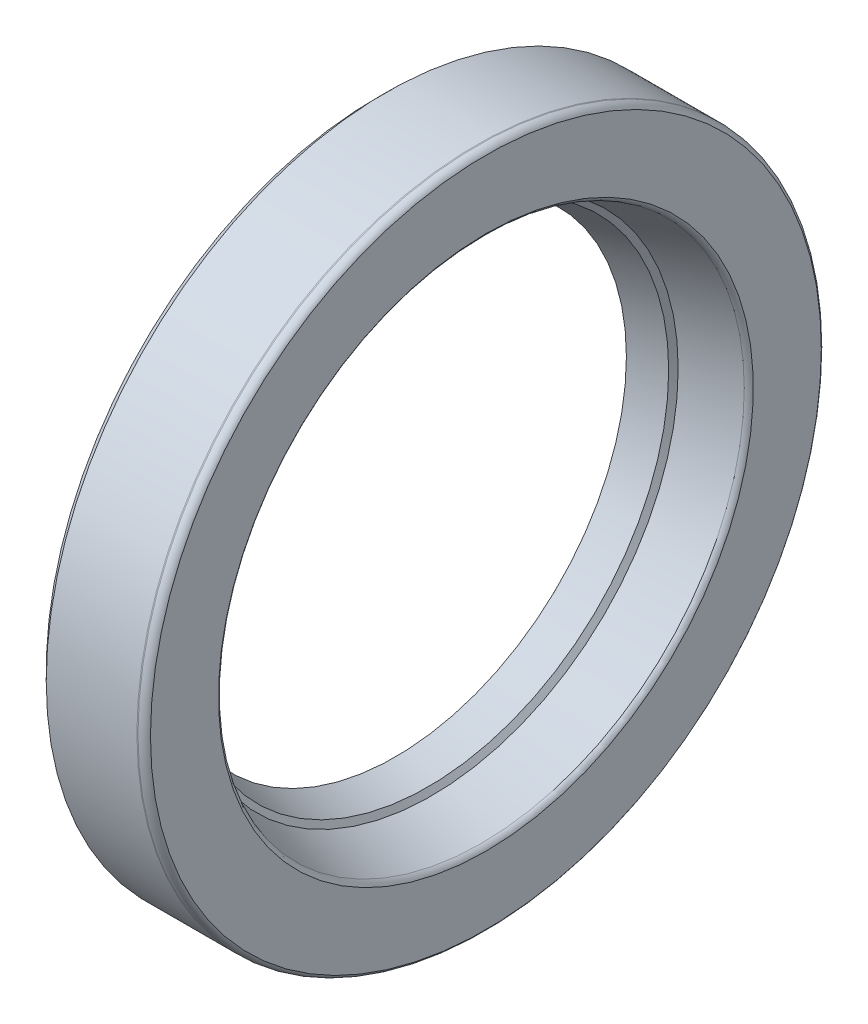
ISO-10303-21;
HEADER;
FILE_DESCRIPTION(('STEP AP214'),'2;1');
FILE_NAME('part.step','',(''),(''),'','','');
FILE_SCHEMA(('AUTOMOTIVE_DESIGN { 1 0 10303 214 1 1 1 1 }'));
ENDSEC;
DATA;
#1=APPLICATION_CONTEXT('core data for automotive mechanical design processes');
#2=APPLICATION_PROTOCOL_DEFINITION('international standard','automotive_design',2000,#1);
#3=PRODUCT_CONTEXT('',#1,'mechanical');
#4=PRODUCT('Part','Part','',(#3));
#5=PRODUCT_RELATED_PRODUCT_CATEGORY('part','',(#4));
#6=PRODUCT_DEFINITION_FORMATION('','',#4);
#7=PRODUCT_DEFINITION_CONTEXT('part definition',#1,'design');
#8=PRODUCT_DEFINITION('design','',#6,#7);
#9=PRODUCT_DEFINITION_SHAPE('','',#8);
#10=(LENGTH_UNIT() NAMED_UNIT(*) SI_UNIT(.MILLI.,.METRE.));
#11=(NAMED_UNIT(*) PLANE_ANGLE_UNIT() SI_UNIT($,.RADIAN.));
#12=(NAMED_UNIT(*) SI_UNIT($,.STERADIAN.) SOLID_ANGLE_UNIT());
#13=UNCERTAINTY_MEASURE_WITH_UNIT(LENGTH_MEASURE(1.E-05),#10,'distance_accuracy_value','');
#14=(GEOMETRIC_REPRESENTATION_CONTEXT(3) GLOBAL_UNCERTAINTY_ASSIGNED_CONTEXT((#13)) GLOBAL_UNIT_ASSIGNED_CONTEXT((#10,
#11,#12)) REPRESENTATION_CONTEXT('',''));
#15=CARTESIAN_POINT('',(0.,0.,0.));
#16=DIRECTION('',(0.,0.,1.));
#17=DIRECTION('',(1.,0.,0.));
#18=AXIS2_PLACEMENT_3D('',#15,#16,#17);
#19=CARTESIAN_POINT('',(2.4,0.,0.));
#20=DIRECTION('',(1.,0.,0.));
#21=DIRECTION('',(0.,0.,-1.));
#22=AXIS2_PLACEMENT_3D('',#19,#20,#21);
#23=CONICAL_SURFACE('',#22,9.83333333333,0.233743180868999);
#24=CARTESIAN_POINT('',(1.48640310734,0.,0.));
#25=DIRECTION('',(-1.,0.,0.));
#26=DIRECTION('',(0.,-1.,0.));
#27=AXIS2_PLACEMENT_3D('',#24,#25,#26);
#28=CIRCLE('',#27,9.61581026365);
#29=CARTESIAN_POINT('',(1.48640310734,-9.61581026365,0.));
#30=VERTEX_POINT('',#29);
#31=EDGE_CURVE('E92',#30,#30,#28,.T.);
#32=ORIENTED_EDGE('',*,*,#31,.F.);
#33=EDGE_LOOP('',(#32));
#34=FACE_BOUND('',#33,.T.);
#35=CARTESIAN_POINT('',(2.4,0.,0.));
#36=DIRECTION('',(1.,0.,0.));
#37=DIRECTION('',(0.,0.,-1.));
#38=AXIS2_PLACEMENT_3D('',#35,#36,#37);
#39=CIRCLE('',#38,9.83333333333);
#40=CARTESIAN_POINT('',(2.4,0.,-9.83333333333));
#41=VERTEX_POINT('',#40);
#42=EDGE_CURVE('E21',#41,#41,#39,.T.);
#43=ORIENTED_EDGE('',*,*,#42,.F.);
#44=EDGE_LOOP('',(#43));
#45=FACE_BOUND('',#44,.T.);
#46=ADVANCED_FACE('F17',(#34,#45),#23,.T.);
#47=CARTESIAN_POINT('',(2.4,10.5833333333,0.));
#48=DIRECTION('',(-1.,0.,0.));
#49=DIRECTION('',(0.,0.,1.));
#50=AXIS2_PLACEMENT_3D('',#47,#48,#49);
#51=PLANE('',#50);
#52=ORIENTED_EDGE('',*,*,#42,.T.);
#53=EDGE_LOOP('',(#52));
#54=FACE_BOUND('',#53,.T.);
#55=CARTESIAN_POINT('',(2.4,-2.48353282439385E-10,-11.3333333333));
#56=CARTESIAN_POINT('',(2.4,0.222347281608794,-11.3333425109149));
#57=CARTESIAN_POINT('',(2.4,0.444699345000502,-11.3267906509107));
#58=CARTESIAN_POINT('',(2.4,0.889019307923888,-11.3006036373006));
#59=CARTESIAN_POINT('',(2.4,1.11098587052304,-11.2809457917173));
#60=CARTESIAN_POINT('',(2.4,1.55336648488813,-11.2285856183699));
#61=CARTESIAN_POINT('',(2.4,1.77378051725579,-11.195883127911));
#62=CARTESIAN_POINT('',(2.4,2.3021759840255,-11.1014857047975));
#63=CARTESIAN_POINT('',(2.4,2.60903890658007,-11.033401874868));
#64=CARTESIAN_POINT('',(2.4,3.21607977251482,-10.8719803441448));
#65=CARTESIAN_POINT('',(2.4,3.51625656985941,-10.778638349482));
#66=CARTESIAN_POINT('',(2.4,4.10781237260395,-10.5673530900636));
#67=CARTESIAN_POINT('',(2.4,4.39919184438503,-10.4494111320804));
#68=CARTESIAN_POINT('',(2.4,4.97113041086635,-10.1897467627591));
#69=CARTESIAN_POINT('',(2.4,5.25169019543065,-10.0480258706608));
#70=CARTESIAN_POINT('',(2.4,5.80008230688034,-9.74177206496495));
#71=CARTESIAN_POINT('',(2.4,6.06791422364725,-9.57723841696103));
#72=CARTESIAN_POINT('',(2.4,6.58899022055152,-9.22649918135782));
#73=CARTESIAN_POINT('',(2.4,6.8422343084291,-9.0402936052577));
#74=CARTESIAN_POINT('',(2.4,7.33242731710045,-8.64746333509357));
#75=CARTESIAN_POINT('',(2.4,7.56937346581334,-8.44083518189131));
#76=CARTESIAN_POINT('',(2.4,8.02520914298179,-8.00868672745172));
#77=CARTESIAN_POINT('',(2.4,8.24410476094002,-7.78317284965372));
#78=CARTESIAN_POINT('',(2.4,8.66172810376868,-7.31552225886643));
#79=CARTESIAN_POINT('',(2.4,8.8605198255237,-7.07344268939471));
#80=CARTESIAN_POINT('',(2.4,9.23739003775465,-6.57366089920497));
#81=CARTESIAN_POINT('',(2.4,9.41546852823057,-6.31595867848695));
#82=CARTESIAN_POINT('',(2.4,9.75027421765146,-5.78578020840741));
#83=CARTESIAN_POINT('',(2.4,9.90692410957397,-5.51325517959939));
#84=CARTESIAN_POINT('',(2.4,10.1970516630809,-4.95612569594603));
#85=CARTESIAN_POINT('',(2.4,10.3305314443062,-4.67152234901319));
#86=CARTESIAN_POINT('',(2.4,10.5124495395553,-4.23761271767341));
#87=CARTESIAN_POINT('',(2.4,10.569960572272,-4.09204905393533));
#88=CARTESIAN_POINT('',(2.4,10.6789088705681,-3.79866226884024));
#89=CARTESIAN_POINT('',(2.4,10.7303460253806,-3.65083910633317));
#90=CARTESIAN_POINT('',(2.4,10.8757337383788,-3.20334762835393));
#91=CARTESIAN_POINT('',(2.4,10.9603660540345,-2.90059820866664));
#92=CARTESIAN_POINT('',(2.4,11.1041899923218,-2.28911702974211));
#93=CARTESIAN_POINT('',(2.4,11.1633817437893,-1.98038530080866));
#94=CARTESIAN_POINT('',(2.4,11.2327069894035,-1.51500689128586));
#95=CARTESIAN_POINT('',(2.4,11.2525550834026,-1.35975549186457));
#96=CARTESIAN_POINT('',(2.4,11.2858072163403,-1.04856396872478));
#97=CARTESIAN_POINT('',(2.4,11.2992112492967,-0.892623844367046));
#98=CARTESIAN_POINT('',(2.4,11.3297838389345,-0.423103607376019));
#99=CARTESIAN_POINT('',(2.4,11.3371622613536,-0.108834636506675));
#100=CARTESIAN_POINT('',(2.4,11.325788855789,0.519230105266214));
#101=CARTESIAN_POINT('',(2.4,11.3070370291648,0.833025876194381));
#102=CARTESIAN_POINT('',(2.4,11.2594853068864,1.30113135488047));
#103=CARTESIAN_POINT('',(2.4,11.2404441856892,1.45648392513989));
#104=CARTESIAN_POINT('',(2.4,11.1959470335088,1.76626751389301));
#105=CARTESIAN_POINT('',(2.4,11.1704910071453,1.9206985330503));
#106=CARTESIAN_POINT('',(2.4,11.0843619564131,2.38326205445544));
#107=CARTESIAN_POINT('',(2.4,11.014031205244,2.68964846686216));
#108=CARTESIAN_POINT('',(2.4,10.8481625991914,3.29552152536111));
#109=CARTESIAN_POINT('',(2.4,10.752624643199,3.59500814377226));
#110=CARTESIAN_POINT('',(2.4,10.5911307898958,4.03694197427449));
#111=CARTESIAN_POINT('',(2.4,10.5343754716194,4.18280564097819));
#112=CARTESIAN_POINT('',(2.4,10.4148764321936,4.472055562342));
#113=CARTESIAN_POINT('',(2.4,10.352132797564,4.61544185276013));
#114=CARTESIAN_POINT('',(2.4,10.1546227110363,5.0424835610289));
#115=CARTESIAN_POINT('',(2.4,10.0109247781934,5.32207023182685));
#116=CARTESIAN_POINT('',(2.4,9.70081588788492,5.86833001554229));
#117=CARTESIAN_POINT('',(2.4,9.53440328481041,6.13500219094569));
#118=CARTESIAN_POINT('',(2.4,9.18062349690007,6.652708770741));
#119=CARTESIAN_POINT('',(2.4,8.99333159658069,6.90379458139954));
#120=CARTESIAN_POINT('',(2.4,8.59861350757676,7.38960407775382));
#121=CARTESIAN_POINT('',(2.4,8.39118731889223,7.62432776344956));
#122=CARTESIAN_POINT('',(2.4,7.9576225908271,8.07580574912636));
#123=CARTESIAN_POINT('',(2.4,7.73148405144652,8.29256004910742));
#124=CARTESIAN_POINT('',(2.4,7.26127479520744,8.70729174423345));
#125=CARTESIAN_POINT('',(2.4,7.01714766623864,8.90520518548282));
#126=CARTESIAN_POINT('',(2.4,6.51320986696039,9.28015163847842));
#127=CARTESIAN_POINT('',(2.4,6.25339329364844,9.45717671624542));
#128=CARTESIAN_POINT('',(2.4,5.72000542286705,9.78900474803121));
#129=CARTESIAN_POINT('',(2.4,5.44643677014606,9.94381195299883));
#130=CARTESIAN_POINT('',(2.4,4.887391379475,10.230175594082));
#131=CARTESIAN_POINT('',(2.4,4.60191458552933,10.3617319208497));
#132=CARTESIAN_POINT('',(2.4,4.02103574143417,10.6006750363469));
#133=CARTESIAN_POINT('',(2.4,3.72563456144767,10.7080639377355));
#134=CARTESIAN_POINT('',(2.4,3.12693092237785,10.8979566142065));
#135=CARTESIAN_POINT('',(2.4,2.82362712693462,10.9804561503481));
#136=CARTESIAN_POINT('',(2.4,2.10504009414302,11.144139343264));
#137=CARTESIAN_POINT('',(2.4,1.68733060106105,11.2149862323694));
#138=CARTESIAN_POINT('',(2.4,1.05683139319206,11.2859408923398));
#139=CARTESIAN_POINT('',(2.4,0.845865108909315,11.3037065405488));
#140=CARTESIAN_POINT('',(2.4,0.42328376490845,11.3274012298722));
#141=CARTESIAN_POINT('',(2.4,0.211668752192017,11.3333311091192));
#142=CARTESIAN_POINT('',(2.4,-2.48342924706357E-10,11.3333333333));
#143=B_SPLINE_CURVE_WITH_KNOTS('',3,(#55,#56,#57,#58,#59,#60,#61,#62,#63,#64,#65,#66,#67,#68,
#69,#70,#71,#72,#73,#74,#75,#76,#77,#78,#79,#80,#81,#82,#83,#84,#85,#86,#87,#88,#89,#90,#91,#92,
#93,#94,#95,#96,#97,#98,#99,#100,#101,#102,#103,#104,#105,#106,#107,#108,#109,#110,#111,#112,
#113,#114,#115,#116,#117,#118,#119,#120,#121,#122,#123,#124,#125,#126,#127,#128,#129,#130,#131,
#132,#133,#134,#135,#136,#137,#138,#139,#140,#141,#142),.UNSPECIFIED.,.F.,.F.,(4,2,2,2,2,2,2,2,
2,2,2,2,2,2,2,2,2,2,2,2,2,2,2,2,2,2,2,2,2,2,2,2,2,2,2,2,2,2,2,2,2,2,2,4),(0.,0.666955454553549,
1.33506869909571,2.00319027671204,2.94502316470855,3.88701626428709,4.8289593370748,
5.7708422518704,6.71275549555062,7.65466823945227,8.59674079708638,9.53849422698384,
10.4771485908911,11.4158029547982,12.3577590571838,13.2996289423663,13.7690525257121,
14.238484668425,15.1804000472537,16.1223106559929,16.5917383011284,17.0611663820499,
18.0030794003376,18.9449923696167,19.4144204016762,19.8838480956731,20.825759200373,
21.7676740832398,22.2371053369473,22.7065298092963,23.6484086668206,24.5903557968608,
25.5290101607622,26.4676645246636,27.406318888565,28.3480536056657,29.2901448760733,
30.2320556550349,31.1739708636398,32.1158037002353,33.0577968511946,34.3257996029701,
34.9606605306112,35.595476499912),.UNSPECIFIED.);
#144=CARTESIAN_POINT('',(2.4,-2.48352477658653E-10,-11.3333333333));
#145=VERTEX_POINT('',#144);
#146=CARTESIAN_POINT('',(2.4,-1.24175253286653E-10,11.3333333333));
#147=VERTEX_POINT('',#146);
#148=EDGE_CURVE('E66',#145,#147,#143,.T.);
#149=ORIENTED_EDGE('',*,*,#148,.F.);
#150=CARTESIAN_POINT('',(2.4,-2.48351894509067E-10,11.3333333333));
#151=CARTESIAN_POINT('',(2.4,-0.222347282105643,11.3333425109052));
#152=CARTESIAN_POINT('',(2.4,-0.444699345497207,11.3267906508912));
#153=CARTESIAN_POINT('',(2.4,-0.889019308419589,11.3006036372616));
#154=CARTESIAN_POINT('',(2.4,-1.11098587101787,11.2809457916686));
#155=CARTESIAN_POINT('',(2.4,-1.55336648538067,11.2285856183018));
#156=CARTESIAN_POINT('',(2.4,-1.7737805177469,11.1958831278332));
#157=CARTESIAN_POINT('',(2.4,-2.30217598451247,11.1014857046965));
#158=CARTESIAN_POINT('',(2.4,-2.60903890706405,11.0334018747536));
#159=CARTESIAN_POINT('',(2.4,-3.21607977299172,10.8719803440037));
#160=CARTESIAN_POINT('',(2.4,-3.51625657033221,10.7786383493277));
#161=CARTESIAN_POINT('',(2.4,-4.10781237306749,10.5673530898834));
#162=CARTESIAN_POINT('',(2.4,-4.39919184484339,10.4494111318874));
#163=CARTESIAN_POINT('',(2.4,-4.97113041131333,10.189746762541));
#164=CARTESIAN_POINT('',(2.4,-5.25169019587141,10.0480258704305));
#165=CARTESIAN_POINT('',(2.4,-5.80008230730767,9.74177206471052));
#166=CARTESIAN_POINT('',(2.4,-6.06791422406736,9.57723841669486));
#167=CARTESIAN_POINT('',(2.4,-6.58899022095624,9.22649918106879));
#168=CARTESIAN_POINT('',(2.4,-6.84223430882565,9.04029360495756));
#169=CARTESIAN_POINT('',(2.4,-7.33242731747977,8.64746333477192));
#170=CARTESIAN_POINT('',(2.4,-7.5693734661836,8.44083518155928));
#171=CARTESIAN_POINT('',(2.4,-8.0252091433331,8.00868672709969));
#172=CARTESIAN_POINT('',(2.4,-8.24410476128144,7.78317284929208));
#173=CARTESIAN_POINT('',(2.4,-8.66172810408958,7.31552225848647));
#174=CARTESIAN_POINT('',(2.4,-8.86051982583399,7.07344268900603));
#175=CARTESIAN_POINT('',(2.4,-9.23739003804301,6.57366089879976));
#176=CARTESIAN_POINT('',(2.4,-9.41546852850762,6.31595867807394));
#177=CARTESIAN_POINT('',(2.4,-9.75027421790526,5.7857802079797));
#178=CARTESIAN_POINT('',(2.4,-9.90692410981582,5.51325517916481));
#179=CARTESIAN_POINT('',(2.4,-10.1970516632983,4.95612569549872));
#180=CARTESIAN_POINT('',(2.4,-10.3305314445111,4.67152234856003));
#181=CARTESIAN_POINT('',(2.4,-10.5124495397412,4.23761271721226));
#182=CARTESIAN_POINT('',(2.4,-10.5699605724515,4.09204905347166));
#183=CARTESIAN_POINT('',(2.4,-10.6789088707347,3.79866226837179));
#184=CARTESIAN_POINT('',(2.4,-10.7303460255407,3.65083910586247));
#185=CARTESIAN_POINT('',(2.4,-10.8757337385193,3.20334762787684));
#186=CARTESIAN_POINT('',(2.4,-10.9603660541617,2.90059820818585));
#187=CARTESIAN_POINT('',(2.4,-11.1041899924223,2.28911702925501));
#188=CARTESIAN_POINT('',(2.4,-11.1633817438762,1.98038530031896));
#189=CARTESIAN_POINT('',(2.4,-11.23270698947,1.51500689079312));
#190=CARTESIAN_POINT('',(2.4,-11.2525550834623,1.35975549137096));
#191=CARTESIAN_POINT('',(2.4,-11.2858072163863,1.04856396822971));
#192=CARTESIAN_POINT('',(2.4,-11.2992112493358,0.892623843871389));
#193=CARTESIAN_POINT('',(2.4,-11.329783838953,0.423103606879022));
#194=CARTESIAN_POINT('',(2.4,-11.3371622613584,0.108834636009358));
#195=CARTESIAN_POINT('',(2.4,-11.3257888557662,-0.519230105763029));
#196=CARTESIAN_POINT('',(2.4,-11.3070370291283,-0.833025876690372));
#197=CARTESIAN_POINT('',(2.4,-11.2594853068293,-1.30113135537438));
#198=CARTESIAN_POINT('',(2.4,-11.2404441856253,-1.45648392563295));
#199=CARTESIAN_POINT('',(2.4,-11.1959470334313,-1.76626751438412));
#200=CARTESIAN_POINT('',(2.4,-11.170491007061,-1.92069853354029));
#201=CARTESIAN_POINT('',(2.4,-11.0843619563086,-2.38326205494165));
#202=CARTESIAN_POINT('',(2.4,-11.014031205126,-2.68964846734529));
#203=CARTESIAN_POINT('',(2.4,-10.8481625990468,-3.29552152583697));
#204=CARTESIAN_POINT('',(2.4,-10.7526246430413,-3.59500814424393));
#205=CARTESIAN_POINT('',(2.4,-10.5911307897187,-4.03694197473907));
#206=CARTESIAN_POINT('',(2.4,-10.5343754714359,-4.18280564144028));
#207=CARTESIAN_POINT('',(2.4,-10.4148764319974,-4.47205556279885));
#208=CARTESIAN_POINT('',(2.4,-10.3521327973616,-4.61544185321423));
#209=CARTESIAN_POINT('',(2.4,-10.1546227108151,-5.04248356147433));
#210=CARTESIAN_POINT('',(2.4,-10.01092477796,-5.32207023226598));
#211=CARTESIAN_POINT('',(2.4,-9.70081588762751,-5.86833001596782));
#212=CARTESIAN_POINT('',(2.4,-9.53440328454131,-6.13500219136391));
#213=CARTESIAN_POINT('',(2.4,-9.18062349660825,-6.6527087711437));
#214=CARTESIAN_POINT('',(2.4,-8.99333159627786,-6.90379458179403));
#215=CARTESIAN_POINT('',(2.4,-8.59861350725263,-7.389604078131));
#216=CARTESIAN_POINT('',(2.4,-8.39118731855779,-7.62432776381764));
#217=CARTESIAN_POINT('',(2.4,-7.95762259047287,-8.07580574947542));
#218=CARTESIAN_POINT('',(2.4,-7.73148405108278,-8.29256004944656));
#219=CARTESIAN_POINT('',(2.4,-7.2612747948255,-8.70729174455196));
#220=CARTESIAN_POINT('',(2.4,-7.01714766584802,-8.90520518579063));
#221=CARTESIAN_POINT('',(2.4,-6.51320986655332,-9.28015163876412));
#222=CARTESIAN_POINT('',(2.4,-6.25339329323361,-9.45717671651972));
#223=CARTESIAN_POINT('',(2.4,-5.72000542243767,-9.78900474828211));
#224=CARTESIAN_POINT('',(2.4,-5.44643676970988,-9.94381195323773));
#225=CARTESIAN_POINT('',(2.4,-4.88739137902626,-10.2301755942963));
#226=CARTESIAN_POINT('',(2.4,-4.60191458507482,-10.3617319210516));
#227=CARTESIAN_POINT('',(2.4,-4.02103574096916,-10.6006750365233));
#228=CARTESIAN_POINT('',(2.4,-3.72563456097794,-10.708063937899));
#229=CARTESIAN_POINT('',(2.4,-3.12693092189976,-10.8979566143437));
#230=CARTESIAN_POINT('',(2.4,-2.8236271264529,-10.980456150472));
#231=CARTESIAN_POINT('',(2.4,-2.10504009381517,-11.1441393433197));
#232=CARTESIAN_POINT('',(2.4,-1.68733060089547,-11.2149862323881));
#233=CARTESIAN_POINT('',(2.4,-1.05683139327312,-11.2859408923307));
#234=CARTESIAN_POINT('',(2.4,-0.845865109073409,-11.3037065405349));
#235=CARTESIAN_POINT('',(2.4,-0.423283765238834,-11.3274012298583));
#236=CARTESIAN_POINT('',(2.4,-0.211668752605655,-11.33333110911));
#237=CARTESIAN_POINT('',(2.4,-2.48361738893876E-10,-11.3333333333));
#238=B_SPLINE_CURVE_WITH_KNOTS('',3,(#150,#151,#152,#153,#154,#155,#156,#157,#158,#159,#160,
#161,#162,#163,#164,#165,#166,#167,#168,#169,#170,#171,#172,#173,#174,#175,#176,#177,#178,#179,
#180,#181,#182,#183,#184,#185,#186,#187,#188,#189,#190,#191,#192,#193,#194,#195,#196,#197,#198,
#199,#200,#201,#202,#203,#204,#205,#206,#207,#208,#209,#210,#211,#212,#213,#214,#215,#216,#217,
#218,#219,#220,#221,#222,#223,#224,#225,#226,#227,#228,#229,#230,#231,#232,#233,#234,#235,#236,
#237),.UNSPECIFIED.,.F.,.F.,(4,2,2,2,2,2,2,2,2,2,2,2,2,2,2,2,2,2,2,2,2,2,2,2,2,2,2,2,2,2,2,2,2,
2,2,2,2,2,2,2,2,2,2,4),(0.,0.66695545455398,1.33506869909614,2.00319027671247,2.94502316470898,
3.88701626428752,4.82895933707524,5.77084225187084,6.71275549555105,7.65466823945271,
8.59674079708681,9.53849422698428,10.4771485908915,11.4158029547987,12.3577590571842,
13.2996289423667,13.7690525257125,14.2384846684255,15.1804000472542,16.1223106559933,
16.5917383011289,17.0611663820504,18.0030794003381,18.9449923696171,19.4144204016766,
19.8838480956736,20.8257592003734,21.7676740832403,22.2371053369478,22.7065298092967,
23.648408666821,24.5903557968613,25.5290101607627,26.467664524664,27.4063188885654,
28.3480536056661,29.2901448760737,30.2320556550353,31.1739708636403,32.1158037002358,
33.057796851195,34.3257996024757,34.9606605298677,35.5954764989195),.UNSPECIFIED.);
#239=EDGE_CURVE('E56',#147,#145,#238,.T.);
#240=ORIENTED_EDGE('',*,*,#239,.F.);
#241=EDGE_LOOP('',(#149,#240));
#242=FACE_BOUND('',#241,.T.);
#243=ADVANCED_FACE('F67',(#54,#242),#51,.T.);
#244=CARTESIAN_POINT('',(1.00000000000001,0.,0.));
#245=DIRECTION('',(1.,0.,0.));
#246=DIRECTION('',(0.,0.,-1.));
#247=AXIS2_PLACEMENT_3D('',#244,#245,#246);
#248=TOROIDAL_SURFACE('',#247,9.49999999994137,0.500000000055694);
#249=ORIENTED_EDGE('',*,*,#31,.T.);
#250=EDGE_LOOP('',(#249));
#251=FACE_BOUND('',#250,.T.);
#252=CARTESIAN_POINT('',(0.782055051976,0.,0.));
#253=DIRECTION('',(1.,0.,0.));
#254=DIRECTION('',(0.,0.,-1.));
#255=AXIS2_PLACEMENT_3D('',#252,#253,#254);
#256=CIRCLE('',#255,9.95);
#257=CARTESIAN_POINT('',(0.782055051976,0.,-9.95));
#258=VERTEX_POINT('',#257);
#259=EDGE_CURVE('E69',#258,#258,#256,.F.);
#260=ORIENTED_EDGE('',*,*,#259,.F.);
#261=EDGE_LOOP('',(#260));
#262=FACE_BOUND('',#261,.T.);
#263=ADVANCED_FACE('F203',(#251,#262),#248,.T.);
#264=CARTESIAN_POINT('',(2.23333333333,0.,11.5));
#265=CARTESIAN_POINT('',(2.23333333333,-23.,11.5));
#266=CARTESIAN_POINT('',(2.23333333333,-23.,-11.5));
#267=CARTESIAN_POINT('',(2.23333333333,0.,-11.5));
#268=CARTESIAN_POINT('',(2.3081646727,0.,11.4662199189));
#269=CARTESIAN_POINT('',(2.3081646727,-22.9324398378,11.4662199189));
#270=CARTESIAN_POINT('',(2.3081646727,-22.9324398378,-11.4662199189));
#271=CARTESIAN_POINT('',(2.3081646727,0.,-11.4662199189));
#272=CARTESIAN_POINT('',(2.36621991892,0.,11.4081646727));
#273=CARTESIAN_POINT('',(2.36621991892,-22.8163293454,11.4081646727));
#274=CARTESIAN_POINT('',(2.36621991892,-22.8163293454,-11.4081646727));
#275=CARTESIAN_POINT('',(2.36621991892,0.,-11.4081646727));
#276=CARTESIAN_POINT('',(2.4,0.,11.3333333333));
#277=CARTESIAN_POINT('',(2.4,-22.6666666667,11.3333333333));
#278=CARTESIAN_POINT('',(2.4,-22.6666666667,-11.3333333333));
#279=CARTESIAN_POINT('',(2.4,0.,-11.3333333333));
#280=(BOUNDED_SURFACE() B_SPLINE_SURFACE(3,3,((#264,#265,#266,#267),(#268,#269,#270,#271),(#272,
#273,#274,#275),(#276,#277,#278,#279)),.UNSPECIFIED.,.F.,.F.,
.F.) B_SPLINE_SURFACE_WITH_KNOTS((4,4),(4,4),(0.,0.332771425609),(0.,68.5615768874),
.UNSPECIFIED.) GEOMETRIC_REPRESENTATION_ITEM() RATIONAL_B_SPLINE_SURFACE(((1.,0.333333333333,
0.333333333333,1.),(0.956942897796,0.318980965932,0.318980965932,0.956942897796),
(0.956942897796,0.318980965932,0.318980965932,0.956942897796),(1.,0.333333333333,0.333333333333,1.))) REPRESENTATION_ITEM('') SURFACE());
#281=CARTESIAN_POINT('',(2.23333333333,0.,-11.5));
#282=CARTESIAN_POINT('',(2.3081646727,0.,-11.4662199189));
#283=CARTESIAN_POINT('',(2.36621991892,0.,-11.4081646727));
#284=CARTESIAN_POINT('',(2.4,0.,-11.3333333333));
#285=(BOUNDED_CURVE() B_SPLINE_CURVE(3,(#281,#282,#283,#284),.UNSPECIFIED.,.F.,
.F.) B_SPLINE_CURVE_WITH_KNOTS((4,4),(0.,0.332771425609),
.UNSPECIFIED.) CURVE() GEOMETRIC_REPRESENTATION_ITEM() RATIONAL_B_SPLINE_CURVE((1.,
0.956942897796,0.956942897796,1.)) REPRESENTATION_ITEM(''));
#286=CARTESIAN_POINT('',(2.23333333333,0.,-11.5));
#287=VERTEX_POINT('',#286);
#288=EDGE_CURVE('E61',#287,#145,#285,.T.);
#289=CARTESIAN_POINT('',(2.23333333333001,0.,0.));
#290=DIRECTION('',(-1.,0.,0.));
#291=DIRECTION('',(0.,0.,-1.));
#292=AXIS2_PLACEMENT_3D('',#289,#290,#291);
#293=CIRCLE('',#292,11.5);
#294=CARTESIAN_POINT('',(2.23333333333,0.,11.5));
#295=VERTEX_POINT('',#294);
#296=EDGE_CURVE('E267',#287,#295,#293,.T.);
#297=CARTESIAN_POINT('',(2.23333333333,0.,11.5));
#298=CARTESIAN_POINT('',(2.3081646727,0.,11.4662199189));
#299=CARTESIAN_POINT('',(2.36621991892,0.,11.4081646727));
#300=CARTESIAN_POINT('',(2.4,0.,11.3333333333));
#301=(BOUNDED_CURVE() B_SPLINE_CURVE(3,(#297,#298,#299,#300),.UNSPECIFIED.,.F.,
.F.) B_SPLINE_CURVE_WITH_KNOTS((4,4),(0.,0.332771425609),
.UNSPECIFIED.) CURVE() GEOMETRIC_REPRESENTATION_ITEM() RATIONAL_B_SPLINE_CURVE((1.,
0.956942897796,0.956942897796,1.)) REPRESENTATION_ITEM(''));
#302=EDGE_CURVE('E64',#147,#295,#301,.F.);
#303=ORIENTED_EDGE('',*,*,#239,.T.);
#304=ORIENTED_EDGE('',*,*,#288,.F.);
#305=ORIENTED_EDGE('',*,*,#296,.T.);
#306=ORIENTED_EDGE('',*,*,#302,.F.);
#307=EDGE_LOOP('',(#303,#304,#305,#306));
#308=FACE_BOUND('',#307,.T.);
#309=ADVANCED_FACE('F59',(#308),#280,.T.);
#310=CARTESIAN_POINT('',(2.23333333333,0.,-11.5));
#311=CARTESIAN_POINT('',(2.23333333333,23.,-11.5));
#312=CARTESIAN_POINT('',(2.23333333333,23.,11.5));
#313=CARTESIAN_POINT('',(2.23333333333,0.,11.5));
#314=CARTESIAN_POINT('',(2.3081646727,0.,-11.4662199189));
#315=CARTESIAN_POINT('',(2.3081646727,22.9324398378,-11.4662199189));
#316=CARTESIAN_POINT('',(2.3081646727,22.9324398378,11.4662199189));
#317=CARTESIAN_POINT('',(2.3081646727,0.,11.4662199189));
#318=CARTESIAN_POINT('',(2.36621991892,0.,-11.4081646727));
#319=CARTESIAN_POINT('',(2.36621991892,22.8163293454,-11.4081646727));
#320=CARTESIAN_POINT('',(2.36621991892,22.8163293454,11.4081646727));
#321=CARTESIAN_POINT('',(2.36621991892,0.,11.4081646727));
#322=CARTESIAN_POINT('',(2.4,0.,-11.3333333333));
#323=CARTESIAN_POINT('',(2.4,22.6666666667,-11.3333333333));
#324=CARTESIAN_POINT('',(2.4,22.6666666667,11.3333333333));
#325=CARTESIAN_POINT('',(2.4,0.,11.3333333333));
#326=(BOUNDED_SURFACE() B_SPLINE_SURFACE(3,3,((#310,#311,#312,#313),(#314,#315,#316,#317),(#318,
#319,#320,#321),(#322,#323,#324,#325)),.UNSPECIFIED.,.F.,.F.,
.F.) B_SPLINE_SURFACE_WITH_KNOTS((4,4),(4,4),(0.,0.332771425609),(0.,68.5615768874),
.UNSPECIFIED.) GEOMETRIC_REPRESENTATION_ITEM() RATIONAL_B_SPLINE_SURFACE(((1.,0.333333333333,
0.333333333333,1.),(0.956942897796,0.318980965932,0.318980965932,0.956942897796),
(0.956942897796,0.318980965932,0.318980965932,0.956942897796),(1.,0.333333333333,0.333333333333,1.))) REPRESENTATION_ITEM('') SURFACE());
#327=CARTESIAN_POINT('',(2.23333333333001,0.,0.));
#328=DIRECTION('',(-1.,0.,0.));
#329=DIRECTION('',(0.,0.,1.));
#330=AXIS2_PLACEMENT_3D('',#327,#328,#329);
#331=CIRCLE('',#330,11.5);
#332=EDGE_CURVE('E73',#295,#287,#331,.T.);
#333=ORIENTED_EDGE('',*,*,#288,.T.);
#334=ORIENTED_EDGE('',*,*,#148,.T.);
#335=ORIENTED_EDGE('',*,*,#302,.T.);
#336=ORIENTED_EDGE('',*,*,#332,.T.);
#337=EDGE_LOOP('',(#333,#334,#335,#336));
#338=FACE_BOUND('',#337,.T.);
#339=ADVANCED_FACE('F71',(#338),#326,.T.);
#340=CARTESIAN_POINT('',(0.524360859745,0.,0.));
#341=DIRECTION('',(1.,0.,0.));
#342=DIRECTION('',(0.,0.,-1.));
#343=AXIS2_PLACEMENT_3D('',#340,#341,#342);
#344=CYLINDRICAL_SURFACE('',#343,9.95);
#345=ORIENTED_EDGE('',*,*,#259,.T.);
#346=EDGE_LOOP('',(#345));
#347=FACE_BOUND('',#346,.T.);
#348=CARTESIAN_POINT('',(0.266666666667,0.,0.));
#349=DIRECTION('',(1.,0.,0.));
#350=DIRECTION('',(0.,0.,-1.));
#351=AXIS2_PLACEMENT_3D('',#348,#349,#350);
#352=CIRCLE('',#351,9.95);
#353=CARTESIAN_POINT('',(0.266666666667,0.,-9.95));
#354=VERTEX_POINT('',#353);
#355=EDGE_CURVE('E111',#354,#354,#352,.F.);
#356=ORIENTED_EDGE('',*,*,#355,.F.);
#357=EDGE_LOOP('',(#356));
#358=FACE_BOUND('',#357,.T.);
#359=ADVANCED_FACE('F129',(#347,#358),#344,.T.);
#360=CARTESIAN_POINT('',(0.,0.,0.));
#361=DIRECTION('',(-1.,0.,0.));
#362=DIRECTION('',(0.,-1.,0.));
#363=AXIS2_PLACEMENT_3D('',#360,#361,#362);
#364=CONICAL_SURFACE('',#363,11.6999999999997,0.0893139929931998);
#365=ORIENTED_EDGE('',*,*,#332,.F.);
#366=ORIENTED_EDGE('',*,*,#296,.F.);
#367=EDGE_LOOP('',(#365,#366));
#368=FACE_BOUND('',#367,.T.);
#369=CARTESIAN_POINT('',(0.,0.,0.));
#370=DIRECTION('',(-1.,0.,0.));
#371=DIRECTION('',(0.,-1.,0.));
#372=AXIS2_PLACEMENT_3D('',#369,#370,#371);
#373=CIRCLE('',#372,11.6999999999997);
#374=CARTESIAN_POINT('',(0.,-11.6999999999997,0.));
#375=VERTEX_POINT('',#374);
#376=EDGE_CURVE('E108',#375,#375,#373,.F.);
#377=ORIENTED_EDGE('',*,*,#376,.F.);
#378=EDGE_LOOP('',(#377));
#379=FACE_BOUND('',#378,.T.);
#380=ADVANCED_FACE('F140',(#368,#379),#364,.F.);
#381=CARTESIAN_POINT('',(0.266666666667,9.51071428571,0.));
#382=DIRECTION('',(-1.,0.,0.));
#383=DIRECTION('',(0.,0.,1.));
#384=AXIS2_PLACEMENT_3D('',#381,#382,#383);
#385=PLANE('',#384);
#386=CARTESIAN_POINT('',(0.266666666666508,0.,0.));
#387=DIRECTION('',(-1.,0.,0.));
#388=DIRECTION('',(0.,0.,1.));
#389=AXIS2_PLACEMENT_3D('',#386,#387,#388);
#390=CIRCLE('',#389,9.07142857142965);
#391=CARTESIAN_POINT('',(0.266666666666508,0.,9.07142857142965));
#392=VERTEX_POINT('',#391);
#393=EDGE_CURVE('E105',#392,#392,#390,.F.);
#394=ORIENTED_EDGE('',*,*,#393,.T.);
#395=EDGE_LOOP('',(#394));
#396=FACE_BOUND('',#395,.T.);
#397=ORIENTED_EDGE('',*,*,#355,.T.);
#398=EDGE_LOOP('',(#397));
#399=FACE_BOUND('',#398,.T.);
#400=ADVANCED_FACE('F144',(#396,#399),#385,.T.);
#401=CARTESIAN_POINT('',(0.,11.9333333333,0.));
#402=DIRECTION('',(-1.,0.,0.));
#403=DIRECTION('',(0.,0.,1.));
#404=AXIS2_PLACEMENT_3D('',#401,#402,#403);
#405=PLANE('',#404);
#406=ORIENTED_EDGE('',*,*,#376,.T.);
#407=EDGE_LOOP('',(#406));
#408=FACE_BOUND('',#407,.T.);
#409=CARTESIAN_POINT('',(1.63515034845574E-11,0.,0.));
#410=DIRECTION('',(1.,0.,0.));
#411=DIRECTION('',(0.,0.,-1.));
#412=AXIS2_PLACEMENT_3D('',#409,#410,#411);
#413=CIRCLE('',#412,12.1666666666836);
#414=CARTESIAN_POINT('',(1.63515034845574E-11,0.,-12.1666666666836));
#415=VERTEX_POINT('',#414);
#416=EDGE_CURVE('E101',#415,#415,#413,.T.);
#417=ORIENTED_EDGE('',*,*,#416,.F.);
#418=EDGE_LOOP('',(#417));
#419=FACE_BOUND('',#418,.T.);
#420=ADVANCED_FACE('F148',(#408,#419),#405,.T.);
#421=CARTESIAN_POINT('',(0.266666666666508,0.,0.));
#422=DIRECTION('',(-1.,0.,0.));
#423=DIRECTION('',(0.,0.,1.));
#424=AXIS2_PLACEMENT_3D('',#421,#422,#423);
#425=CONICAL_SURFACE('',#424,9.07142857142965,0.960070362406);
#426=CARTESIAN_POINT('',(0.666666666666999,0.,0.));
#427=DIRECTION('',(1.,0.,0.));
#428=DIRECTION('',(0.,0.,-1.));
#429=AXIS2_PLACEMENT_3D('',#426,#427,#428);
#430=CIRCLE('',#429,8.5);
#431=CARTESIAN_POINT('',(0.666666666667,0.,-8.5));
#432=VERTEX_POINT('',#431);
#433=EDGE_CURVE('E104',#432,#432,#430,.T.);
#434=ORIENTED_EDGE('',*,*,#433,.T.);
#435=EDGE_LOOP('',(#434));
#436=FACE_BOUND('',#435,.T.);
#437=ORIENTED_EDGE('',*,*,#393,.F.);
#438=EDGE_LOOP('',(#437));
#439=FACE_BOUND('',#438,.T.);
#440=ADVANCED_FACE('F152',(#436,#439),#425,.F.);
#441=CARTESIAN_POINT('',(0.3333333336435,0.,0.));
#442=DIRECTION('',(1.,0.,0.));
#443=DIRECTION('',(0.,0.,-1.));
#444=AXIS2_PLACEMENT_3D('',#441,#442,#443);
#445=CONICAL_SURFACE('',#444,12.5000000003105,0.785398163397);
#446=ORIENTED_EDGE('',*,*,#416,.T.);
#447=EDGE_LOOP('',(#446));
#448=FACE_BOUND('',#447,.T.);
#449=CARTESIAN_POINT('',(0.333333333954,0.,0.));
#450=DIRECTION('',(1.,0.,0.));
#451=DIRECTION('',(0.,0.,-1.));
#452=AXIS2_PLACEMENT_3D('',#449,#450,#451);
#453=CIRCLE('',#452,12.5);
#454=CARTESIAN_POINT('',(0.333333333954,0.,-12.5));
#455=VERTEX_POINT('',#454);
#456=EDGE_CURVE('E262',#455,#455,#453,.T.);
#457=ORIENTED_EDGE('',*,*,#456,.F.);
#458=EDGE_LOOP('',(#457));
#459=FACE_BOUND('',#458,.T.);
#460=ADVANCED_FACE('F156',(#448,#459),#445,.T.);
#461=CARTESIAN_POINT('',(1.86666666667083,0.,0.));
#462=DIRECTION('',(1.,0.,0.));
#463=DIRECTION('',(0.,0.,-1.));
#464=AXIS2_PLACEMENT_3D('',#461,#462,#463);
#465=CONICAL_SURFACE('',#464,8.85555555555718,0.288055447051);
#466=ORIENTED_EDGE('',*,*,#433,.F.);
#467=EDGE_LOOP('',(#466));
#468=FACE_BOUND('',#467,.T.);
#469=CARTESIAN_POINT('',(1.86666666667,0.,0.));
#470=DIRECTION('',(1.,0.,0.));
#471=DIRECTION('',(0.,0.,-1.));
#472=AXIS2_PLACEMENT_3D('',#469,#470,#471);
#473=CIRCLE('',#472,8.85555555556);
#474=CARTESIAN_POINT('',(1.86666666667,0.,-8.85555555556));
#475=VERTEX_POINT('',#474);
#476=EDGE_CURVE('E254',#475,#475,#473,.T.);
#477=ORIENTED_EDGE('',*,*,#476,.T.);
#478=EDGE_LOOP('',(#477));
#479=FACE_BOUND('',#478,.T.);
#480=ADVANCED_FACE('F160',(#468,#479),#465,.F.);
#481=CARTESIAN_POINT('',(2.,0.,0.));
#482=DIRECTION('',(1.,0.,0.));
#483=DIRECTION('',(0.,0.,-1.));
#484=AXIS2_PLACEMENT_3D('',#481,#482,#483);
#485=CYLINDRICAL_SURFACE('',#484,12.5);
#486=ORIENTED_EDGE('',*,*,#456,.T.);
#487=EDGE_LOOP('',(#486));
#488=FACE_BOUND('',#487,.T.);
#489=CARTESIAN_POINT('',(3.66666666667,0.,0.));
#490=DIRECTION('',(1.,0.,0.));
#491=DIRECTION('',(0.,0.,-1.));
#492=AXIS2_PLACEMENT_3D('',#489,#490,#491);
#493=CIRCLE('',#492,12.5);
#494=CARTESIAN_POINT('',(3.66666666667,0.,12.5));
#495=VERTEX_POINT('',#494);
#496=CARTESIAN_POINT('',(3.66666666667,0.,-12.5));
#497=VERTEX_POINT('',#496);
#498=EDGE_CURVE('E234',#495,#497,#493,.T.);
#499=ORIENTED_EDGE('',*,*,#498,.F.);
#500=CARTESIAN_POINT('',(3.66666666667,0.,0.));
#501=DIRECTION('',(1.,0.,0.));
#502=DIRECTION('',(0.,0.,-1.));
#503=AXIS2_PLACEMENT_3D('',#500,#501,#502);
#504=CIRCLE('',#503,12.5);
#505=EDGE_CURVE('E243',#497,#495,#504,.T.);
#506=ORIENTED_EDGE('',*,*,#505,.F.);
#507=EDGE_LOOP('',(#499,#506));
#508=FACE_BOUND('',#507,.T.);
#509=ADVANCED_FACE('F164',(#488,#508),#485,.T.);
#510=CARTESIAN_POINT('',(2.00000000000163,0.,0.));
#511=DIRECTION('',(1.,0.,0.));
#512=DIRECTION('',(0.,0.,-1.));
#513=AXIS2_PLACEMENT_3D('',#510,#511,#512);
#514=CONICAL_SURFACE('',#513,9.071428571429,1.01750200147);
#515=ORIENTED_EDGE('',*,*,#476,.F.);
#516=EDGE_LOOP('',(#515));
#517=FACE_BOUND('',#516,.T.);
#518=CARTESIAN_POINT('',(2.,0.,0.));
#519=DIRECTION('',(1.,0.,0.));
#520=DIRECTION('',(0.,0.,-1.));
#521=AXIS2_PLACEMENT_3D('',#518,#519,#520);
#522=CIRCLE('',#521,9.07142857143);
#523=CARTESIAN_POINT('',(2.,0.,-9.07142857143));
#524=VERTEX_POINT('',#523);
#525=EDGE_CURVE('E219',#524,#524,#522,.T.);
#526=ORIENTED_EDGE('',*,*,#525,.T.);
#527=EDGE_LOOP('',(#526));
#528=FACE_BOUND('',#527,.T.);
#529=ADVANCED_FACE('F168',(#517,#528),#514,.F.);
#530=CARTESIAN_POINT('',(3.70973002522,0.,-12.5027933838));
#531=CARTESIAN_POINT('',(3.70973002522,25.0055867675,-12.5027933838));
#532=CARTESIAN_POINT('',(3.70973002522,25.0055867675,12.5027933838));
#533=CARTESIAN_POINT('',(3.70973002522,0.,12.5027933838));
#534=CARTESIAN_POINT('',(3.69532526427,0.,-12.5027933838));
#535=CARTESIAN_POINT('',(3.69532526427,25.0055867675,-12.5027933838));
#536=CARTESIAN_POINT('',(3.69532526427,25.0055867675,12.5027933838));
#537=CARTESIAN_POINT('',(3.69532526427,0.,12.5027933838));
#538=CARTESIAN_POINT('',(3.68095071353,0.,-12.5018609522));
#539=CARTESIAN_POINT('',(3.68095071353,25.0037219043,-12.5018609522));
#540=CARTESIAN_POINT('',(3.68095071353,25.0037219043,12.5018609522));
#541=CARTESIAN_POINT('',(3.68095071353,0.,12.5018609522));
#542=CARTESIAN_POINT('',(3.66666666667,0.,-12.5));
#543=CARTESIAN_POINT('',(3.66666666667,25.,-12.5));
#544=CARTESIAN_POINT('',(3.66666666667,25.,12.5));
#545=CARTESIAN_POINT('',(3.66666666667,0.,12.5));
#546=(BOUNDED_SURFACE() B_SPLINE_SURFACE(3,3,((#530,#531,#532,#533),(#534,#535,#536,#537),(#538,
#539,#540,#541),(#542,#543,#544,#545)),.UNSPECIFIED.,.F.,.F.,
.F.) B_SPLINE_SURFACE_WITH_KNOTS((4,4),(4,4),(0.,0.0435109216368),(0.,75.0111715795),
.UNSPECIFIED.) GEOMETRIC_REPRESENTATION_ITEM() RATIONAL_B_SPLINE_SURFACE(((1.,0.333333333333,
0.333333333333,1.),(0.998601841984,0.332867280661,0.332867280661,0.998601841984),
(0.998601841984,0.332867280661,0.332867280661,0.998601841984),(1.,0.333333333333,0.333333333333,1.))) REPRESENTATION_ITEM('') SURFACE());
#547=CARTESIAN_POINT('',(3.70973002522,0.,-12.5027933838));
#548=CARTESIAN_POINT('',(3.69532526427,0.,-12.5027933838));
#549=CARTESIAN_POINT('',(3.68095071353,0.,-12.5018609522));
#550=CARTESIAN_POINT('',(3.66666666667,0.,-12.5));
#551=(BOUNDED_CURVE() B_SPLINE_CURVE(3,(#547,#548,#549,#550),.UNSPECIFIED.,.F.,
.F.) B_SPLINE_CURVE_WITH_KNOTS((4,4),(0.,0.0435109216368),
.UNSPECIFIED.) CURVE() GEOMETRIC_REPRESENTATION_ITEM() RATIONAL_B_SPLINE_CURVE((1.,
0.998601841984,0.998601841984,1.)) REPRESENTATION_ITEM(''));
#552=CARTESIAN_POINT('',(3.70973002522,0.,-12.5027933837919));
#553=VERTEX_POINT('',#552);
#554=EDGE_CURVE('E224',#497,#553,#551,.F.);
#555=CARTESIAN_POINT('',(3.70973002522,0.,12.5027933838));
#556=CARTESIAN_POINT('',(3.69532526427,0.,12.5027933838));
#557=CARTESIAN_POINT('',(3.68095071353,0.,12.5018609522));
#558=CARTESIAN_POINT('',(3.66666666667,0.,12.5));
#559=(BOUNDED_CURVE() B_SPLINE_CURVE(3,(#555,#556,#557,#558),.UNSPECIFIED.,.F.,
.F.) B_SPLINE_CURVE_WITH_KNOTS((4,4),(0.,0.0435109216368),
.UNSPECIFIED.) CURVE() GEOMETRIC_REPRESENTATION_ITEM() RATIONAL_B_SPLINE_CURVE((1.,
0.998601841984,0.998601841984,1.)) REPRESENTATION_ITEM(''));
#560=CARTESIAN_POINT('',(3.70973002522,0.,12.5027933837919));
#561=VERTEX_POINT('',#560);
#562=EDGE_CURVE('E223',#561,#495,#559,.T.);
#563=CARTESIAN_POINT('',(3.70973002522,0.,0.));
#564=DIRECTION('',(1.,0.,0.));
#565=DIRECTION('',(0.,1.,0.));
#566=AXIS2_PLACEMENT_3D('',#563,#564,#565);
#567=CIRCLE('',#566,12.5027933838);
#568=EDGE_CURVE('E36',#553,#561,#567,.T.);
#569=ORIENTED_EDGE('',*,*,#554,.F.);
#570=ORIENTED_EDGE('',*,*,#505,.T.);
#571=ORIENTED_EDGE('',*,*,#562,.F.);
#572=ORIENTED_EDGE('',*,*,#568,.F.);
#573=EDGE_LOOP('',(#569,#570,#571,#572));
#574=FACE_BOUND('',#573,.T.);
#575=ADVANCED_FACE('F172',(#574),#546,.T.);
#576=CARTESIAN_POINT('',(3.70973002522,0.,12.5027933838));
#577=CARTESIAN_POINT('',(3.70973002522,-25.0055867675,12.5027933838));
#578=CARTESIAN_POINT('',(3.70973002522,-25.0055867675,-12.5027933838));
#579=CARTESIAN_POINT('',(3.70973002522,0.,-12.5027933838));
#580=CARTESIAN_POINT('',(3.69532526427,0.,12.5027933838));
#581=CARTESIAN_POINT('',(3.69532526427,-25.0055867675,12.5027933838));
#582=CARTESIAN_POINT('',(3.69532526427,-25.0055867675,-12.5027933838));
#583=CARTESIAN_POINT('',(3.69532526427,0.,-12.5027933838));
#584=CARTESIAN_POINT('',(3.68095071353,0.,12.5018609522));
#585=CARTESIAN_POINT('',(3.68095071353,-25.0037219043,12.5018609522));
#586=CARTESIAN_POINT('',(3.68095071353,-25.0037219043,-12.5018609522));
#587=CARTESIAN_POINT('',(3.68095071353,0.,-12.5018609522));
#588=CARTESIAN_POINT('',(3.66666666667,0.,12.5));
#589=CARTESIAN_POINT('',(3.66666666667,-25.,12.5));
#590=CARTESIAN_POINT('',(3.66666666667,-25.,-12.5));
#591=CARTESIAN_POINT('',(3.66666666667,0.,-12.5));
#592=(BOUNDED_SURFACE() B_SPLINE_SURFACE(3,3,((#576,#577,#578,#579),(#580,#581,#582,#583),(#584,
#585,#586,#587),(#588,#589,#590,#591)),.UNSPECIFIED.,.F.,.F.,
.F.) B_SPLINE_SURFACE_WITH_KNOTS((4,4),(4,4),(0.,0.0435109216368),(0.,75.0111715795),
.UNSPECIFIED.) GEOMETRIC_REPRESENTATION_ITEM() RATIONAL_B_SPLINE_SURFACE(((1.,0.333333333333,
0.333333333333,1.),(0.998601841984,0.332867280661,0.332867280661,0.998601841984),
(0.998601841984,0.332867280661,0.332867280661,0.998601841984),(1.,0.333333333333,0.333333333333,1.))) REPRESENTATION_ITEM('') SURFACE());
#593=CARTESIAN_POINT('',(3.70973002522,0.,0.));
#594=DIRECTION('',(1.,0.,0.));
#595=DIRECTION('',(0.,1.,0.));
#596=AXIS2_PLACEMENT_3D('',#593,#594,#595);
#597=CIRCLE('',#596,12.5027933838);
#598=EDGE_CURVE('E218',#561,#553,#597,.T.);
#599=ORIENTED_EDGE('',*,*,#498,.T.);
#600=ORIENTED_EDGE('',*,*,#554,.T.);
#601=ORIENTED_EDGE('',*,*,#598,.F.);
#602=ORIENTED_EDGE('',*,*,#562,.T.);
#603=EDGE_LOOP('',(#599,#600,#601,#602));
#604=FACE_BOUND('',#603,.T.);
#605=ADVANCED_FACE('F178',(#604),#592,.T.);
#606=CARTESIAN_POINT('',(3.8333333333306,0.,0.));
#607=DIRECTION('',(1.,0.,0.));
#608=DIRECTION('',(0.,1.,0.));
#609=AXIS2_PLACEMENT_3D('',#606,#607,#608);
#610=CONICAL_SURFACE('',#609,9.66666666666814,0.313938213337);
#611=ORIENTED_EDGE('',*,*,#525,.F.);
#612=EDGE_LOOP('',(#611));
#613=FACE_BOUND('',#612,.T.);
#614=CARTESIAN_POINT('',(3.83333333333,0.,0.));
#615=DIRECTION('',(-1.,0.,0.));
#616=DIRECTION('',(0.,-1.,0.));
#617=AXIS2_PLACEMENT_3D('',#614,#615,#616);
#618=CIRCLE('',#617,9.66666666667);
#619=CARTESIAN_POINT('',(3.83333333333,-9.66666666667,0.));
#620=VERTEX_POINT('',#619);
#621=EDGE_CURVE('E100',#620,#620,#618,.T.);
#622=ORIENTED_EDGE('',*,*,#621,.F.);
#623=EDGE_LOOP('',(#622));
#624=FACE_BOUND('',#623,.T.);
#625=ADVANCED_FACE('F188',(#613,#624),#610,.F.);
#626=CARTESIAN_POINT('',(3.70973002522,0.,0.));
#627=DIRECTION('',(1.,0.,0.));
#628=DIRECTION('',(0.,0.,-1.));
#629=AXIS2_PLACEMENT_3D('',#626,#627,#628);
#630=TOROIDAL_SURFACE('',#629,12.1694600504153,0.333333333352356);
#631=ORIENTED_EDGE('',*,*,#568,.T.);
#632=ORIENTED_EDGE('',*,*,#598,.T.);
#633=EDGE_LOOP('',(#631,#632));
#634=FACE_BOUND('',#633,.T.);
#635=CARTESIAN_POINT('',(3.99999999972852,0.,0.));
#636=DIRECTION('',(1.,0.,0.));
#637=DIRECTION('',(0.,0.,-1.));
#638=AXIS2_PLACEMENT_3D('',#635,#636,#637);
#639=CIRCLE('',#638,12.3333333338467);
#640=CARTESIAN_POINT('',(3.99999999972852,0.,-12.3333333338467));
#641=VERTEX_POINT('',#640);
#642=EDGE_CURVE('E27',#641,#641,#639,.T.);
#643=ORIENTED_EDGE('',*,*,#642,.F.);
#644=EDGE_LOOP('',(#643));
#645=FACE_BOUND('',#644,.T.);
#646=ADVANCED_FACE('F197',(#634,#645),#630,.T.);
#647=CARTESIAN_POINT('',(3.69618739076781,0.,0.));
#648=DIRECTION('',(1.,0.,0.));
#649=DIRECTION('',(0.,1.,0.));
#650=AXIS2_PLACEMENT_3D('',#647,#648,#649);
#651=TOROIDAL_SURFACE('',#650,9.97047927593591,0.333333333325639);
#652=ORIENTED_EDGE('',*,*,#621,.T.);
#653=EDGE_LOOP('',(#652));
#654=FACE_BOUND('',#653,.T.);
#655=CARTESIAN_POINT('',(4.,0.,0.));
#656=DIRECTION('',(1.,0.,0.));
#657=DIRECTION('',(0.,1.,0.));
#658=AXIS2_PLACEMENT_3D('',#655,#656,#657);
#659=CIRCLE('',#658,9.83333333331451);
#660=CARTESIAN_POINT('',(4.,9.83333333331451,0.));
#661=VERTEX_POINT('',#660);
#662=EDGE_CURVE('E11',#661,#661,#659,.F.);
#663=ORIENTED_EDGE('',*,*,#662,.F.);
#664=EDGE_LOOP('',(#663));
#665=FACE_BOUND('',#664,.T.);
#666=ADVANCED_FACE('F19',(#654,#665),#651,.T.);
#667=CARTESIAN_POINT('',(4.,11.0833333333,0.));
#668=DIRECTION('',(1.,0.,0.));
#669=DIRECTION('',(0.,0.,-1.));
#670=AXIS2_PLACEMENT_3D('',#667,#668,#669);
#671=PLANE('',#670);
#672=ORIENTED_EDGE('',*,*,#662,.T.);
#673=EDGE_LOOP('',(#672));
#674=FACE_BOUND('',#673,.T.);
#675=ORIENTED_EDGE('',*,*,#642,.T.);
#676=EDGE_LOOP('',(#675));
#677=FACE_BOUND('',#676,.T.);
#678=ADVANCED_FACE('F199',(#674,#677),#671,.T.);
#679=CLOSED_SHELL('',(#46,#243,#263,#309,#339,#359,#380,#400,#420,#440,#460,#480,#509,#529,#575,
#605,#625,#646,#666,#678));
#680=MANIFOLD_SOLID_BREP('B1',#679);
#681=ADVANCED_BREP_SHAPE_REPRESENTATION('',(#18,#680),#14);
#682=SHAPE_DEFINITION_REPRESENTATION(#9,#681);
ENDSEC;
END-ISO-10303-21;
